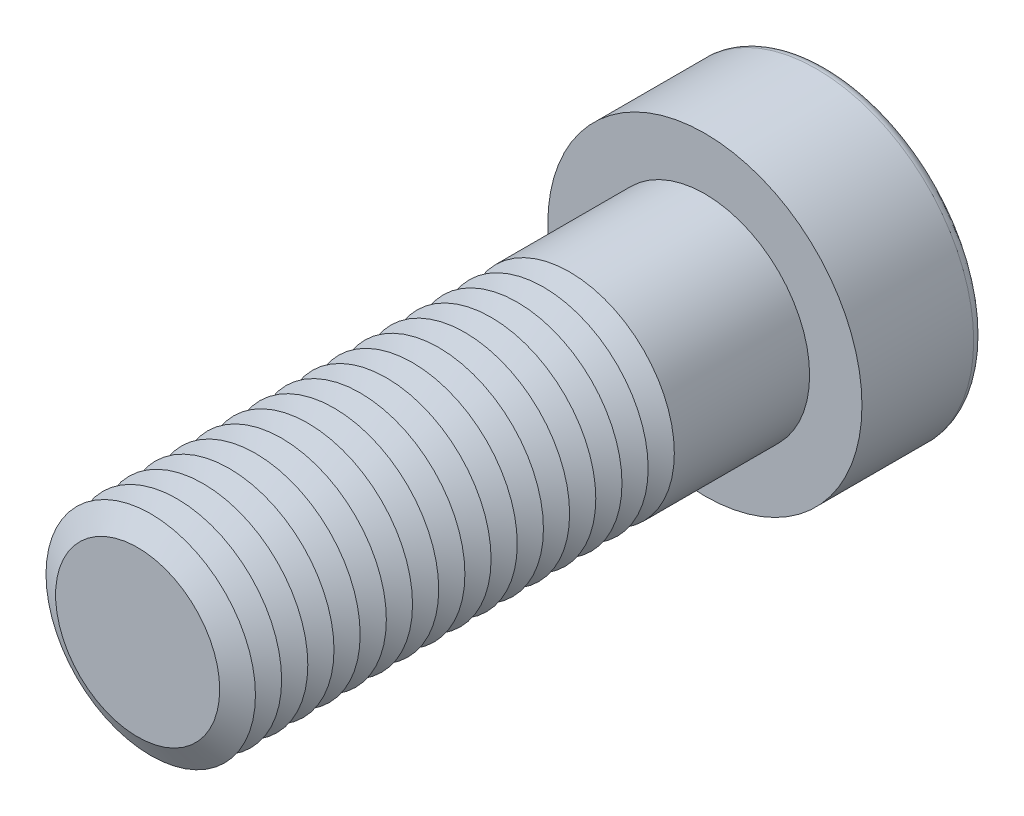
from build123d import *

# Parameters (mm, degrees)
SKETCH1_R           = 12
BOSS_EXTRUDE1_DEPTH = 65
SKETCH2_R           = 18
BOSS_EXTRUDE2_DEPTH = 14
CUT_EXTRUDE1_DEPTH  = 14.25
FILLET1_R           = 1.2
LPATTERN1_COUNT     = 17
LPATTERN1_PITCH     = 3


with BuildPart() as part:
    # Sketch1 → Boss-Extrude1 (new body)
    with BuildSketch(Plane.XY):
        Circle(SKETCH1_R)
    extrude(amount=BOSS_EXTRUDE1_DEPTH)

    # Sketch2 → Boss-Extrude2 (add)
    with BuildSketch(Plane(origin=(0, 0, 0), x_dir=(-1, 0, 0), z_dir=(0, 0, -1))):
        Circle(SKETCH2_R)
    extrude(amount=BOSS_EXTRUDE2_DEPTH)

    # Sketch3 → Cut-Extrude1 (cut)
    with BuildSketch(Plane(origin=(0, 0, -14), x_dir=(-1, 0, 0), z_dir=(0, 0, -1))):
        Polygon((-5.484827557, 9.5), (-10.969655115, 0), (-5.484827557, -9.5), (5.484827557, -9.5), (10.969655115, 0), (5.484827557, 9.5), align=None)
    extrude(amount=-CUT_EXTRUDE1_DEPTH, mode=Mode.SUBTRACT)

    # Fillet1
    fillet1_edges = [part.edges().sort_by_distance(p)[0] for p in [
        (18, 0, -14),
    ]]
    fillet(fillet1_edges, radius=FILLET1_R)

    # Cut-Extrude2 cone 1 section (on through the dimple's axis) → Cut-Extrude2 (revolve, cut)
    with BuildSketch(Plane(origin=(0, 0, 0.25), x_dir=(0, 1, 0), z_dir=(1, 0, 0))):
        Polygon((0, 0), (9.5, 0), (0, 5.484827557), align=None)
    revolve(axis=Axis((0, 0, 0.25), (0, 0, 1)), mode=Mode.SUBTRACT)

    # Cut-Extrude3 cone 1 section (on through the dimple's axis) → Cut-Extrude3 (revolve, cut)
    with BuildSketch(Plane(origin=(0, 0, -14), x_dir=(0, 1, 0), z_dir=(1, 0, 0))):
        Polygon((0, 0), (10.969655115, 0), (0, 2.939310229), align=None)
    revolve(axis=Axis((0, 0, -14), (0, 0, 1)), mode=Mode.SUBTRACT)

    # Sketch7 → Cut-Revolve1 (revolve, cut)
    with BuildSketch(Plane(origin=(0, 0, 0), x_dir=(0, 0, -1), z_dir=(1, 0, 0)), mode=Mode.PRIVATE) as cut_revolve1_sk:
        Polygon((-65, 9.401923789), (-63.5, 12), (-66.5, 12), align=None)
    cut_revolve1 = revolve(cut_revolve1_sk.sketch.rotate(Axis((0, 0, 65), (0, 0, -1)), 90), axis=Axis((0, 0, 65), (0, 0, -1)), mode=Mode.SUBTRACT)

    # LPattern1: Cut-Revolve1 ×17
    with Locations(*[(0, 0, -i * LPATTERN1_PITCH) for i in range(1, LPATTERN1_COUNT)]):
        add(cut_revolve1, mode=Mode.SUBTRACT)


solid = part.part
